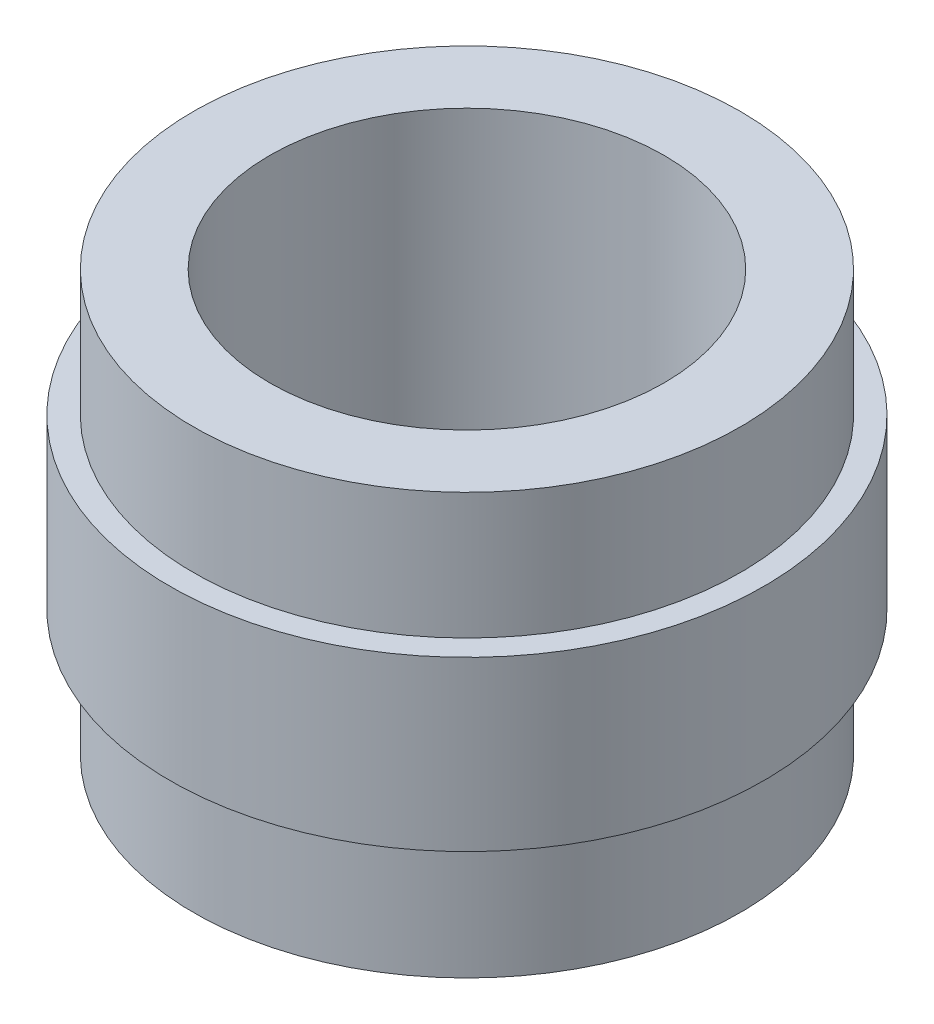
ISO-10303-21;
HEADER;
FILE_DESCRIPTION(('STEP AP214'),'2;1');
FILE_NAME('part.step','',(''),(''),'','','');
FILE_SCHEMA(('AUTOMOTIVE_DESIGN { 1 0 10303 214 1 1 1 1 }'));
ENDSEC;
DATA;
#1=APPLICATION_CONTEXT('core data for automotive mechanical design processes');
#2=APPLICATION_PROTOCOL_DEFINITION('international standard','automotive_design',2000,#1);
#3=PRODUCT_CONTEXT('',#1,'mechanical');
#4=PRODUCT('Part','Part','',(#3));
#5=PRODUCT_RELATED_PRODUCT_CATEGORY('part','',(#4));
#6=PRODUCT_DEFINITION_FORMATION('','',#4);
#7=PRODUCT_DEFINITION_CONTEXT('part definition',#1,'design');
#8=PRODUCT_DEFINITION('design','',#6,#7);
#9=PRODUCT_DEFINITION_SHAPE('','',#8);
#10=(LENGTH_UNIT() NAMED_UNIT(*) SI_UNIT(.MILLI.,.METRE.));
#11=(NAMED_UNIT(*) PLANE_ANGLE_UNIT() SI_UNIT($,.RADIAN.));
#12=(NAMED_UNIT(*) SI_UNIT($,.STERADIAN.) SOLID_ANGLE_UNIT());
#13=UNCERTAINTY_MEASURE_WITH_UNIT(LENGTH_MEASURE(1.E-05),#10,'distance_accuracy_value','');
#14=(GEOMETRIC_REPRESENTATION_CONTEXT(3) GLOBAL_UNCERTAINTY_ASSIGNED_CONTEXT((#13)) GLOBAL_UNIT_ASSIGNED_CONTEXT((#10,
#11,#12)) REPRESENTATION_CONTEXT('',''));
#15=CARTESIAN_POINT('',(0.,0.,0.));
#16=DIRECTION('',(0.,0.,1.));
#17=DIRECTION('',(1.,0.,0.));
#18=AXIS2_PLACEMENT_3D('',#15,#16,#17);
#19=CARTESIAN_POINT('',(0.,0.,0.));
#20=DIRECTION('',(0.,-1.,0.));
#21=DIRECTION('',(0.,0.,-1.));
#22=AXIS2_PLACEMENT_3D('',#19,#20,#21);
#23=CYLINDRICAL_SURFACE('',#22,1.875);
#24=CARTESIAN_POINT('',(0.,0.,0.));
#25=DIRECTION('',(0.,-1.,0.));
#26=DIRECTION('',(0.,0.,-1.));
#27=AXIS2_PLACEMENT_3D('',#24,#25,#26);
#28=CIRCLE('',#27,1.875);
#29=CARTESIAN_POINT('',(0.,0.,-1.875));
#30=VERTEX_POINT('',#29);
#31=EDGE_CURVE('E57',#30,#30,#28,.T.);
#32=ORIENTED_EDGE('',*,*,#31,.T.);
#33=EDGE_LOOP('',(#32));
#34=FACE_BOUND('',#33,.T.);
#35=CARTESIAN_POINT('',(0.,4.,0.));
#36=DIRECTION('',(0.,-1.,0.));
#37=DIRECTION('',(0.,0.,-1.));
#38=AXIS2_PLACEMENT_3D('',#35,#36,#37);
#39=CIRCLE('',#38,1.875);
#40=CARTESIAN_POINT('',(0.,4.,-1.875));
#41=VERTEX_POINT('',#40);
#42=EDGE_CURVE('E10',#41,#41,#39,.T.);
#43=ORIENTED_EDGE('',*,*,#42,.F.);
#44=EDGE_LOOP('',(#43));
#45=FACE_BOUND('',#44,.T.);
#46=ADVANCED_FACE('F29',(#34,#45),#23,.F.);
#47=CARTESIAN_POINT('',(1.875,4.,0.));
#48=DIRECTION('',(0.,1.,0.));
#49=DIRECTION('',(0.,0.,1.));
#50=AXIS2_PLACEMENT_3D('',#47,#48,#49);
#51=PLANE('',#50);
#52=ORIENTED_EDGE('',*,*,#42,.T.);
#53=EDGE_LOOP('',(#52));
#54=FACE_BOUND('',#53,.T.);
#55=CARTESIAN_POINT('',(0.,4.,0.));
#56=DIRECTION('',(0.,-1.,0.));
#57=DIRECTION('',(0.,0.,-1.));
#58=AXIS2_PLACEMENT_3D('',#55,#56,#57);
#59=CIRCLE('',#58,2.6);
#60=CARTESIAN_POINT('',(0.,4.,-2.6));
#61=VERTEX_POINT('',#60);
#62=EDGE_CURVE('E35',#61,#61,#59,.T.);
#63=ORIENTED_EDGE('',*,*,#62,.F.);
#64=EDGE_LOOP('',(#63));
#65=FACE_BOUND('',#64,.T.);
#66=ADVANCED_FACE('F75',(#54,#65),#51,.T.);
#67=CARTESIAN_POINT('',(0.,0.,0.));
#68=DIRECTION('',(0.,-1.,0.));
#69=DIRECTION('',(0.,0.,-1.));
#70=AXIS2_PLACEMENT_3D('',#67,#68,#69);
#71=CYLINDRICAL_SURFACE('',#70,2.6);
#72=ORIENTED_EDGE('',*,*,#62,.T.);
#73=EDGE_LOOP('',(#72));
#74=FACE_BOUND('',#73,.T.);
#75=CARTESIAN_POINT('',(0.,2.8,0.));
#76=DIRECTION('',(0.,-1.,0.));
#77=DIRECTION('',(0.,0.,-1.));
#78=AXIS2_PLACEMENT_3D('',#75,#76,#77);
#79=CIRCLE('',#78,2.6);
#80=CARTESIAN_POINT('',(0.,2.8,-2.6));
#81=VERTEX_POINT('',#80);
#82=EDGE_CURVE('E39',#81,#81,#79,.T.);
#83=ORIENTED_EDGE('',*,*,#82,.F.);
#84=EDGE_LOOP('',(#83));
#85=FACE_BOUND('',#84,.T.);
#86=ADVANCED_FACE('F79',(#74,#85),#71,.T.);
#87=CARTESIAN_POINT('',(2.6,2.8,0.));
#88=DIRECTION('',(0.,1.,0.));
#89=DIRECTION('',(0.,0.,1.));
#90=AXIS2_PLACEMENT_3D('',#87,#88,#89);
#91=PLANE('',#90);
#92=ORIENTED_EDGE('',*,*,#82,.T.);
#93=EDGE_LOOP('',(#92));
#94=FACE_BOUND('',#93,.T.);
#95=CARTESIAN_POINT('',(0.,2.8,0.));
#96=DIRECTION('',(0.,-1.,0.));
#97=DIRECTION('',(0.,0.,-1.));
#98=AXIS2_PLACEMENT_3D('',#95,#96,#97);
#99=CIRCLE('',#98,2.825);
#100=CARTESIAN_POINT('',(0.,2.8,-2.825));
#101=VERTEX_POINT('',#100);
#102=EDGE_CURVE('E43',#101,#101,#99,.T.);
#103=ORIENTED_EDGE('',*,*,#102,.F.);
#104=EDGE_LOOP('',(#103));
#105=FACE_BOUND('',#104,.T.);
#106=ADVANCED_FACE('F83',(#94,#105),#91,.T.);
#107=CARTESIAN_POINT('',(0.,0.,0.));
#108=DIRECTION('',(0.,-1.,0.));
#109=DIRECTION('',(0.,0.,-1.));
#110=AXIS2_PLACEMENT_3D('',#107,#108,#109);
#111=CYLINDRICAL_SURFACE('',#110,2.825);
#112=ORIENTED_EDGE('',*,*,#102,.T.);
#113=EDGE_LOOP('',(#112));
#114=FACE_BOUND('',#113,.T.);
#115=CARTESIAN_POINT('',(0.,1.2,0.));
#116=DIRECTION('',(0.,-1.,0.));
#117=DIRECTION('',(0.,0.,-1.));
#118=AXIS2_PLACEMENT_3D('',#115,#116,#117);
#119=CIRCLE('',#118,2.825);
#120=CARTESIAN_POINT('',(0.,1.2,-2.825));
#121=VERTEX_POINT('',#120);
#122=EDGE_CURVE('E48',#121,#121,#119,.T.);
#123=ORIENTED_EDGE('',*,*,#122,.F.);
#124=EDGE_LOOP('',(#123));
#125=FACE_BOUND('',#124,.T.);
#126=ADVANCED_FACE('F89',(#114,#125),#111,.T.);
#127=CARTESIAN_POINT('',(2.825,1.2,0.));
#128=DIRECTION('',(0.,-1.,0.));
#129=DIRECTION('',(0.,0.,-1.));
#130=AXIS2_PLACEMENT_3D('',#127,#128,#129);
#131=PLANE('',#130);
#132=ORIENTED_EDGE('',*,*,#122,.T.);
#133=EDGE_LOOP('',(#132));
#134=FACE_BOUND('',#133,.T.);
#135=CARTESIAN_POINT('',(0.,1.2,0.));
#136=DIRECTION('',(0.,-1.,0.));
#137=DIRECTION('',(0.,0.,-1.));
#138=AXIS2_PLACEMENT_3D('',#135,#136,#137);
#139=CIRCLE('',#138,2.6);
#140=CARTESIAN_POINT('',(0.,1.2,-2.6));
#141=VERTEX_POINT('',#140);
#142=EDGE_CURVE('E51',#141,#141,#139,.T.);
#143=ORIENTED_EDGE('',*,*,#142,.F.);
#144=EDGE_LOOP('',(#143));
#145=FACE_BOUND('',#144,.T.);
#146=ADVANCED_FACE('F71',(#134,#145),#131,.T.);
#147=CARTESIAN_POINT('',(0.,0.,0.));
#148=DIRECTION('',(0.,-1.,0.));
#149=DIRECTION('',(0.,0.,-1.));
#150=AXIS2_PLACEMENT_3D('',#147,#148,#149);
#151=CYLINDRICAL_SURFACE('',#150,2.6);
#152=ORIENTED_EDGE('',*,*,#142,.T.);
#153=EDGE_LOOP('',(#152));
#154=FACE_BOUND('',#153,.T.);
#155=CARTESIAN_POINT('',(0.,0.,0.));
#156=DIRECTION('',(0.,-1.,0.));
#157=DIRECTION('',(0.,0.,-1.));
#158=AXIS2_PLACEMENT_3D('',#155,#156,#157);
#159=CIRCLE('',#158,2.6);
#160=CARTESIAN_POINT('',(0.,0.,-2.6));
#161=VERTEX_POINT('',#160);
#162=EDGE_CURVE('E54',#161,#161,#159,.T.);
#163=ORIENTED_EDGE('',*,*,#162,.F.);
#164=EDGE_LOOP('',(#163));
#165=FACE_BOUND('',#164,.T.);
#166=ADVANCED_FACE('F65',(#154,#165),#151,.T.);
#167=CARTESIAN_POINT('',(1.875,0.,0.));
#168=DIRECTION('',(0.,-1.,0.));
#169=DIRECTION('',(0.,0.,-1.));
#170=AXIS2_PLACEMENT_3D('',#167,#168,#169);
#171=PLANE('',#170);
#172=ORIENTED_EDGE('',*,*,#162,.T.);
#173=EDGE_LOOP('',(#172));
#174=FACE_BOUND('',#173,.T.);
#175=ORIENTED_EDGE('',*,*,#31,.F.);
#176=EDGE_LOOP('',(#175));
#177=FACE_BOUND('',#176,.T.);
#178=ADVANCED_FACE('F63',(#174,#177),#171,.T.);
#179=CLOSED_SHELL('',(#46,#66,#86,#106,#126,#146,#166,#178));
#180=MANIFOLD_SOLID_BREP('B2',#179);
#181=ADVANCED_BREP_SHAPE_REPRESENTATION('',(#18,#180),#14);
#182=SHAPE_DEFINITION_REPRESENTATION(#9,#181);
ENDSEC;
END-ISO-10303-21;
